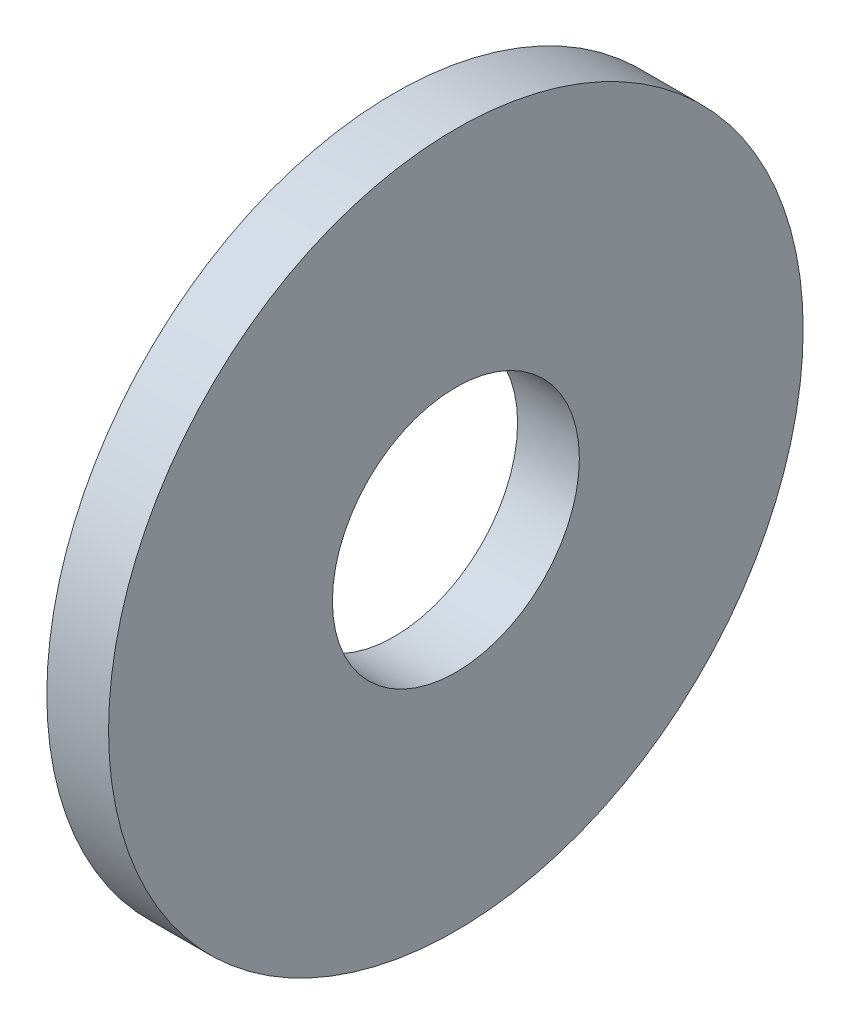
from build123d import *

# Parameters (mm, degrees)
SKETCH1_W = 0.8
SKETCH1_H = 2.9


with BuildPart() as part:
    # Sketch1 → Base-Revolve (revolve)
    with BuildSketch(Plane.XY, mode=Mode.PRIVATE) as base_revolve_sk:
        with Locations((-0.4, 3.05)):
            Rectangle(SKETCH1_W, SKETCH1_H)
    revolve(base_revolve_sk.sketch.rotate(Axis((-34.925, 0, 0), (1, 0, 0)), 90), axis=Axis((-34.925, 0, 0), (1, 0, 0)))


solid = part.part
